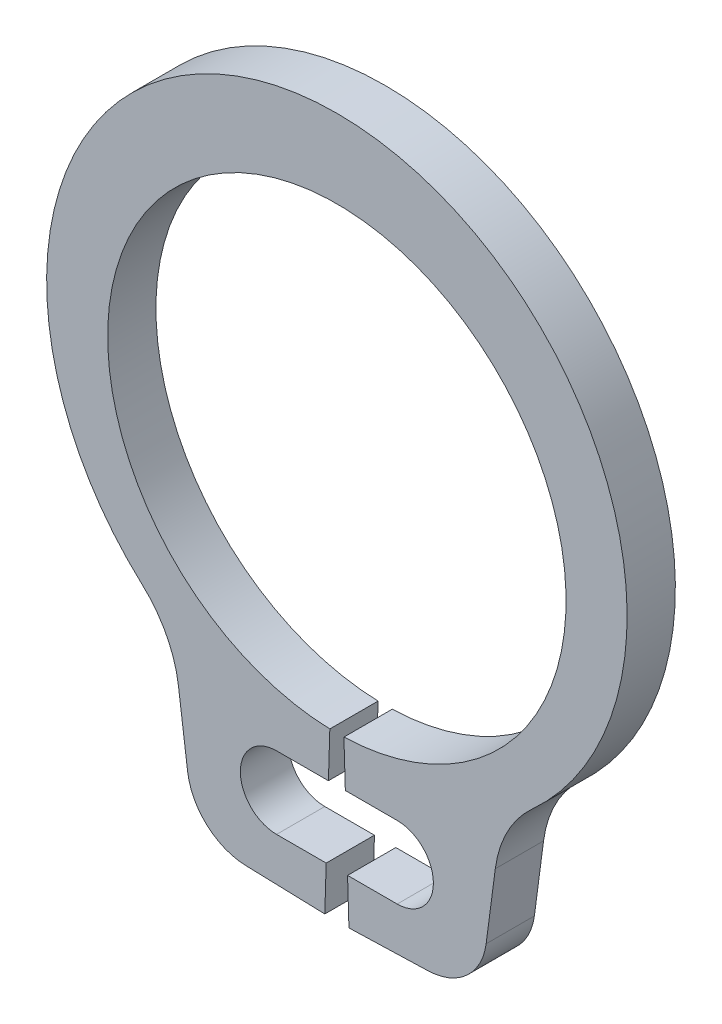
from build123d import *

# Parameters (mm, degrees)
BODYSKE_R   = 0.3
BODY_DEPTH  = 0.4
NOTSKE_W    = 1
NOTSKE_H    = 0.6
NOTCH_DEPTH = 5.062114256


with BuildPart() as part:
    # BodySke → Body (new body)
    with BuildSketch(Plane.XY):
        with BuildLine():
            Line((0.058461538, -1.899100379), (0.1, -3.248461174))
            Line((0.1, -3.248461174), (0.756909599, -3.228238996))
            ThreePointArc((0.756909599, -3.228238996), (1.076942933, -3.09927865), (1.237247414, -2.793738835))
            Line((1.237247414, -2.793738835), (1.313177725, -2.21699086))
            ThreePointArc((1.313177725, -2.21699086), (1.413421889, -1.900430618), (1.616544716, -1.637751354))
            ThreePointArc((1.616544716, -1.637751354), (0, 2.55), (-1.616544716, -1.637751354))
            ThreePointArc((-1.616544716, -1.637751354), (-1.413421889, -1.900430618), (-1.313177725, -2.21699086))
            Line((-1.313177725, -2.21699086), (-1.237247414, -2.793738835))
            ThreePointArc((-1.237247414, -2.793738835), (-1.076942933, -3.09927865), (-0.756909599, -3.228238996))
            Line((-0.756909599, -3.228238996), (-0.1, -3.248461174))
            Line((-0.1, -3.248461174), (-0.058461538, -1.899100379))
            ThreePointArc((-0.058461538, -1.899100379), (0, 1.9), (0.058461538, -1.899100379))
        make_face()
        with Locations((0.5, -2.576941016)):
            Circle(BODYSKE_R, mode=Mode.SUBTRACT)
        with Locations((-0.5, -2.576941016)):
            Circle(BODYSKE_R, mode=Mode.SUBTRACT)
    extrude(amount=-BODY_DEPTH)

    # NotSke → Notch (cut, through all)
    with BuildSketch(Plane.XY):
        with Locations((0, -2.576941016)):
            Rectangle(NOTSKE_W, NOTSKE_H)
    extrude(amount=-NOTCH_DEPTH, mode=Mode.SUBTRACT)


solid = part.part
